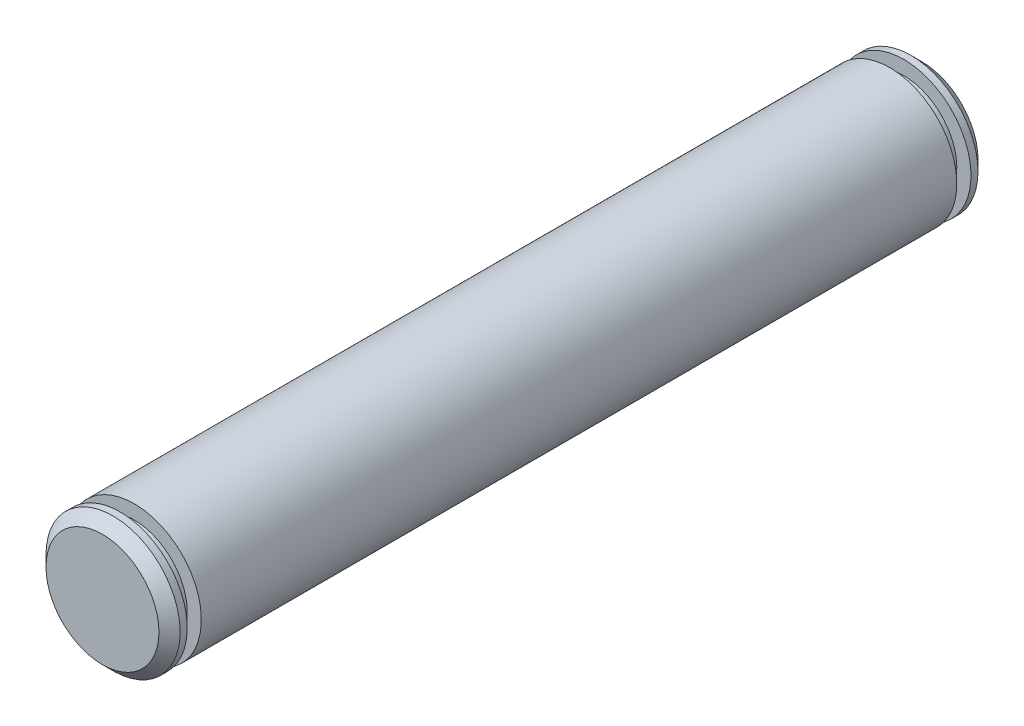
from build123d import *

# Parameters (mm, degrees)
ESQUISSE1_R                = 9.5
BASE_EXTRUSION_DEPTH       = 116
CHANFREIN1_SIZE            = 1.5
ESQUISSE2_R                = 12
ESQUISSE2_R_2              = 7.5
ENL_V_MAT_EXTRU_1_DEPTH    = 2
R_P_TITION_LIN_AIRE1_COUNT = 2
R_P_TITION_LIN_AIRE1_PITCH = 109


with BuildPart() as part:
    # Esquisse1 → Base-Extrusion (new body)
    with BuildSketch(Plane.XY):
        with Locations(Location((0, 0, 0), (0, 0, 180))):
            Circle(ESQUISSE1_R)
    extrude(amount=BASE_EXTRUSION_DEPTH)

    # Chanfrein1
    chanfrein1_edges = [part.edges().sort_by_distance(p)[0] for p in [
        (9.5, 0, 0),
        (9.5, 0, 116),
    ]]
    chamfer(chanfrein1_edges, length=CHANFREIN1_SIZE)

    # Esquisse2 → Enl_v. mat.-Extru.1 (cut)
    with BuildSketch(Plane.XY.offset(113.5)):
        Circle(ESQUISSE2_R)
        Circle(ESQUISSE2_R_2, mode=Mode.SUBTRACT)
    enl_v_mat_extru_1 = extrude(amount=-ENL_V_MAT_EXTRU_1_DEPTH, mode=Mode.SUBTRACT)

    # R_p_tition lin_aire1: Enl_v. mat.-Extru.1 ×2
    with Locations(*[(0, 0, -i * R_P_TITION_LIN_AIRE1_PITCH) for i in range(1, R_P_TITION_LIN_AIRE1_COUNT)]):
        add(enl_v_mat_extru_1, mode=Mode.SUBTRACT)


solid = part.part
